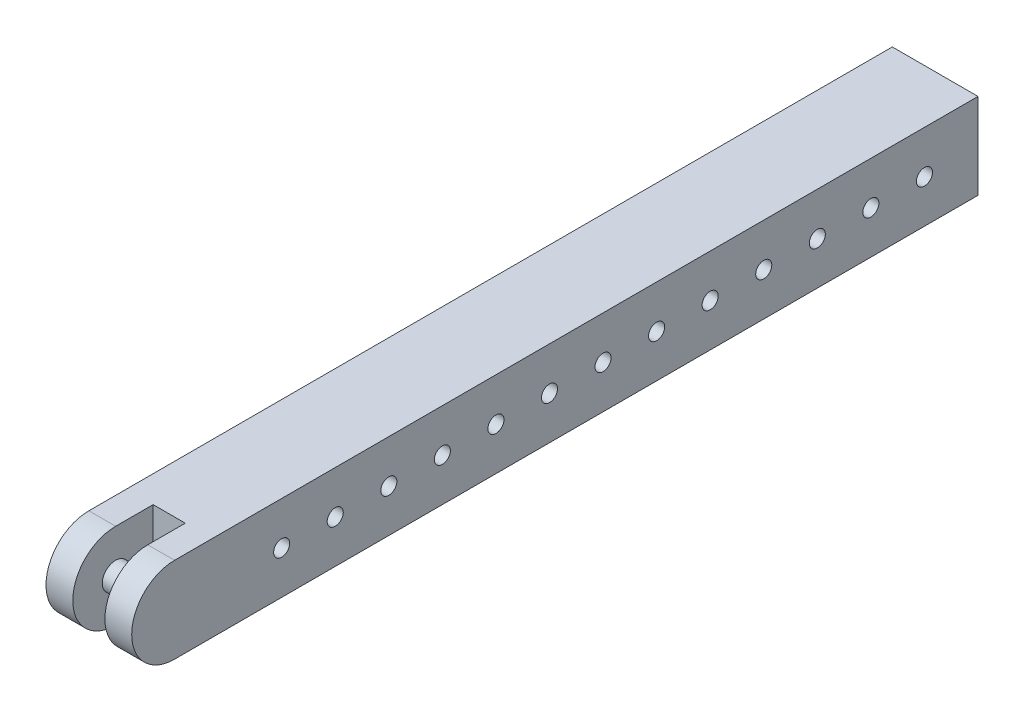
ISO-10303-21;
HEADER;
FILE_DESCRIPTION(('STEP AP214'),'2;1');
FILE_NAME('part.step','',(''),(''),'','','');
FILE_SCHEMA(('AUTOMOTIVE_DESIGN { 1 0 10303 214 1 1 1 1 }'));
ENDSEC;
DATA;
#1=APPLICATION_CONTEXT('core data for automotive mechanical design processes');
#2=APPLICATION_PROTOCOL_DEFINITION('international standard','automotive_design',2000,#1);
#3=PRODUCT_CONTEXT('',#1,'mechanical');
#4=PRODUCT('Part','Part','',(#3));
#5=PRODUCT_RELATED_PRODUCT_CATEGORY('part','',(#4));
#6=PRODUCT_DEFINITION_FORMATION('','',#4);
#7=PRODUCT_DEFINITION_CONTEXT('part definition',#1,'design');
#8=PRODUCT_DEFINITION('design','',#6,#7);
#9=PRODUCT_DEFINITION_SHAPE('','',#8);
#10=(LENGTH_UNIT() NAMED_UNIT(*) SI_UNIT(.MILLI.,.METRE.));
#11=(NAMED_UNIT(*) PLANE_ANGLE_UNIT() SI_UNIT($,.RADIAN.));
#12=(NAMED_UNIT(*) SI_UNIT($,.STERADIAN.) SOLID_ANGLE_UNIT());
#13=UNCERTAINTY_MEASURE_WITH_UNIT(LENGTH_MEASURE(1.E-05),#10,'distance_accuracy_value','');
#14=(GEOMETRIC_REPRESENTATION_CONTEXT(3) GLOBAL_UNCERTAINTY_ASSIGNED_CONTEXT((#13)) GLOBAL_UNIT_ASSIGNED_CONTEXT((#10,
#11,#12)) REPRESENTATION_CONTEXT('',''));
#15=CARTESIAN_POINT('',(0.,0.,0.));
#16=DIRECTION('',(0.,0.,1.));
#17=DIRECTION('',(1.,0.,0.));
#18=AXIS2_PLACEMENT_3D('',#15,#16,#17);
#19=CARTESIAN_POINT('',(-38.6274169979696,8.,150.));
#20=DIRECTION('',(1.,0.,0.));
#21=DIRECTION('',(0.,1.,0.));
#22=AXIS2_PLACEMENT_3D('',#19,#20,#21);
#23=CYLINDRICAL_SURFACE('',#22,8.00000000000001);
#24=DIRECTION('',(-1.,0.,0.));
#25=VECTOR('',#24,1.);
#26=CARTESIAN_POINT('',(0.,16.,150.));
#27=LINE('',#26,#25);
#28=CARTESIAN_POINT('',(0.,16.,150.));
#29=VERTEX_POINT('',#28);
#30=CARTESIAN_POINT('',(-5.,16.,150.));
#31=VERTEX_POINT('',#30);
#32=EDGE_CURVE('E83',#29,#31,#27,.T.);
#33=ORIENTED_EDGE('',*,*,#32,.T.);
#34=CARTESIAN_POINT('',(-5.,8.,150.));
#35=DIRECTION('',(-1.,0.,0.));
#36=DIRECTION('',(0.,0.,1.));
#37=AXIS2_PLACEMENT_3D('',#34,#35,#36);
#38=CIRCLE('',#37,8.00000000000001);
#39=CARTESIAN_POINT('',(-5.,0.,150.));
#40=VERTEX_POINT('',#39);
#41=EDGE_CURVE('E169',#31,#40,#38,.F.);
#42=ORIENTED_EDGE('',*,*,#41,.T.);
#43=DIRECTION('',(-1.,0.,0.));
#44=VECTOR('',#43,1.);
#45=CARTESIAN_POINT('',(0.,0.,150.));
#46=LINE('',#45,#44);
#47=CARTESIAN_POINT('',(0.,0.,150.));
#48=VERTEX_POINT('',#47);
#49=EDGE_CURVE('E150',#48,#40,#46,.T.);
#50=ORIENTED_EDGE('',*,*,#49,.F.);
#51=CARTESIAN_POINT('',(0.,8.,150.));
#52=DIRECTION('',(1.,0.,0.));
#53=DIRECTION('',(0.,1.,0.));
#54=AXIS2_PLACEMENT_3D('',#51,#52,#53);
#55=CIRCLE('',#54,8.00000000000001);
#56=EDGE_CURVE('E141',#29,#48,#55,.T.);
#57=ORIENTED_EDGE('',*,*,#56,.F.);
#58=EDGE_LOOP('',(#33,#42,#50,#57));
#59=FACE_BOUND('',#58,.T.);
#60=ADVANCED_FACE('F33',(#59),#23,.T.);
#61=CARTESIAN_POINT('',(0.,0.,150.));
#62=DIRECTION('',(-1.,0.,0.));
#63=DIRECTION('',(0.,-1.,0.));
#64=AXIS2_PLACEMENT_3D('',#61,#62,#63);
#65=PLANE('',#64);
#66=CARTESIAN_POINT('',(0.,8.,10.));
#67=DIRECTION('',(1.,0.,0.));
#68=DIRECTION('',(0.,1.,0.));
#69=AXIS2_PLACEMENT_3D('',#66,#67,#68);
#70=CIRCLE('',#69,1.5);
#71=CARTESIAN_POINT('',(0.,9.5,10.));
#72=VERTEX_POINT('',#71);
#73=EDGE_CURVE('E418',#72,#72,#70,.T.);
#74=ORIENTED_EDGE('',*,*,#73,.F.);
#75=EDGE_LOOP('',(#74));
#76=FACE_BOUND('',#75,.T.);
#77=CARTESIAN_POINT('',(0.,8.,20.));
#78=DIRECTION('',(1.,0.,0.));
#79=DIRECTION('',(0.,1.,0.));
#80=AXIS2_PLACEMENT_3D('',#77,#78,#79);
#81=CIRCLE('',#80,1.5);
#82=CARTESIAN_POINT('',(0.,9.5,20.));
#83=VERTEX_POINT('',#82);
#84=EDGE_CURVE('E420',#83,#83,#81,.T.);
#85=ORIENTED_EDGE('',*,*,#84,.F.);
#86=EDGE_LOOP('',(#85));
#87=FACE_BOUND('',#86,.T.);
#88=CARTESIAN_POINT('',(0.,8.,30.));
#89=DIRECTION('',(1.,0.,0.));
#90=DIRECTION('',(0.,1.,0.));
#91=AXIS2_PLACEMENT_3D('',#88,#89,#90);
#92=CIRCLE('',#91,1.5);
#93=CARTESIAN_POINT('',(0.,9.5,30.));
#94=VERTEX_POINT('',#93);
#95=EDGE_CURVE('E426',#94,#94,#92,.T.);
#96=ORIENTED_EDGE('',*,*,#95,.F.);
#97=EDGE_LOOP('',(#96));
#98=FACE_BOUND('',#97,.T.);
#99=CARTESIAN_POINT('',(0.,8.,40.));
#100=DIRECTION('',(1.,0.,0.));
#101=DIRECTION('',(0.,1.,0.));
#102=AXIS2_PLACEMENT_3D('',#99,#100,#101);
#103=CIRCLE('',#102,1.5);
#104=CARTESIAN_POINT('',(0.,9.5,40.));
#105=VERTEX_POINT('',#104);
#106=EDGE_CURVE('E432',#105,#105,#103,.T.);
#107=ORIENTED_EDGE('',*,*,#106,.F.);
#108=EDGE_LOOP('',(#107));
#109=FACE_BOUND('',#108,.T.);
#110=CARTESIAN_POINT('',(0.,8.,50.));
#111=DIRECTION('',(1.,0.,0.));
#112=DIRECTION('',(0.,1.,0.));
#113=AXIS2_PLACEMENT_3D('',#110,#111,#112);
#114=CIRCLE('',#113,1.5);
#115=CARTESIAN_POINT('',(0.,9.5,50.));
#116=VERTEX_POINT('',#115);
#117=EDGE_CURVE('E438',#116,#116,#114,.T.);
#118=ORIENTED_EDGE('',*,*,#117,.F.);
#119=EDGE_LOOP('',(#118));
#120=FACE_BOUND('',#119,.T.);
#121=CARTESIAN_POINT('',(0.,8.,60.));
#122=DIRECTION('',(1.,0.,0.));
#123=DIRECTION('',(0.,1.,0.));
#124=AXIS2_PLACEMENT_3D('',#121,#122,#123);
#125=CIRCLE('',#124,1.5);
#126=CARTESIAN_POINT('',(0.,9.5,60.));
#127=VERTEX_POINT('',#126);
#128=EDGE_CURVE('E444',#127,#127,#125,.T.);
#129=ORIENTED_EDGE('',*,*,#128,.F.);
#130=EDGE_LOOP('',(#129));
#131=FACE_BOUND('',#130,.T.);
#132=CARTESIAN_POINT('',(0.,8.,70.));
#133=DIRECTION('',(1.,0.,0.));
#134=DIRECTION('',(0.,1.,0.));
#135=AXIS2_PLACEMENT_3D('',#132,#133,#134);
#136=CIRCLE('',#135,1.5);
#137=CARTESIAN_POINT('',(0.,9.5,70.));
#138=VERTEX_POINT('',#137);
#139=EDGE_CURVE('E450',#138,#138,#136,.T.);
#140=ORIENTED_EDGE('',*,*,#139,.F.);
#141=EDGE_LOOP('',(#140));
#142=FACE_BOUND('',#141,.T.);
#143=CARTESIAN_POINT('',(0.,8.,80.));
#144=DIRECTION('',(1.,0.,0.));
#145=DIRECTION('',(0.,1.,0.));
#146=AXIS2_PLACEMENT_3D('',#143,#144,#145);
#147=CIRCLE('',#146,1.5);
#148=CARTESIAN_POINT('',(0.,9.5,80.));
#149=VERTEX_POINT('',#148);
#150=EDGE_CURVE('E456',#149,#149,#147,.T.);
#151=ORIENTED_EDGE('',*,*,#150,.F.);
#152=EDGE_LOOP('',(#151));
#153=FACE_BOUND('',#152,.T.);
#154=CARTESIAN_POINT('',(0.,8.,90.));
#155=DIRECTION('',(1.,0.,0.));
#156=DIRECTION('',(0.,1.,0.));
#157=AXIS2_PLACEMENT_3D('',#154,#155,#156);
#158=CIRCLE('',#157,1.5);
#159=CARTESIAN_POINT('',(0.,9.5,90.));
#160=VERTEX_POINT('',#159);
#161=EDGE_CURVE('E462',#160,#160,#158,.T.);
#162=ORIENTED_EDGE('',*,*,#161,.F.);
#163=EDGE_LOOP('',(#162));
#164=FACE_BOUND('',#163,.T.);
#165=CARTESIAN_POINT('',(0.,8.,100.));
#166=DIRECTION('',(1.,0.,0.));
#167=DIRECTION('',(0.,1.,0.));
#168=AXIS2_PLACEMENT_3D('',#165,#166,#167);
#169=CIRCLE('',#168,1.5);
#170=CARTESIAN_POINT('',(0.,9.5,100.));
#171=VERTEX_POINT('',#170);
#172=EDGE_CURVE('E468',#171,#171,#169,.T.);
#173=ORIENTED_EDGE('',*,*,#172,.F.);
#174=EDGE_LOOP('',(#173));
#175=FACE_BOUND('',#174,.T.);
#176=CARTESIAN_POINT('',(0.,8.,110.));
#177=DIRECTION('',(1.,0.,0.));
#178=DIRECTION('',(0.,1.,0.));
#179=AXIS2_PLACEMENT_3D('',#176,#177,#178);
#180=CIRCLE('',#179,1.5);
#181=CARTESIAN_POINT('',(0.,9.5,110.));
#182=VERTEX_POINT('',#181);
#183=EDGE_CURVE('E474',#182,#182,#180,.T.);
#184=ORIENTED_EDGE('',*,*,#183,.F.);
#185=EDGE_LOOP('',(#184));
#186=FACE_BOUND('',#185,.T.);
#187=CARTESIAN_POINT('',(0.,8.,120.));
#188=DIRECTION('',(1.,0.,0.));
#189=DIRECTION('',(0.,1.,0.));
#190=AXIS2_PLACEMENT_3D('',#187,#188,#189);
#191=CIRCLE('',#190,1.5);
#192=CARTESIAN_POINT('',(0.,9.5,120.));
#193=VERTEX_POINT('',#192);
#194=EDGE_CURVE('E480',#193,#193,#191,.T.);
#195=ORIENTED_EDGE('',*,*,#194,.F.);
#196=EDGE_LOOP('',(#195));
#197=FACE_BOUND('',#196,.T.);
#198=CARTESIAN_POINT('',(0.,8.,130.));
#199=DIRECTION('',(1.,0.,0.));
#200=DIRECTION('',(0.,1.,0.));
#201=AXIS2_PLACEMENT_3D('',#198,#199,#200);
#202=CIRCLE('',#201,1.5);
#203=CARTESIAN_POINT('',(0.,9.5,130.));
#204=VERTEX_POINT('',#203);
#205=EDGE_CURVE('E486',#204,#204,#202,.T.);
#206=ORIENTED_EDGE('',*,*,#205,.F.);
#207=EDGE_LOOP('',(#206));
#208=FACE_BOUND('',#207,.T.);
#209=DIRECTION('',(0.,0.,-1.));
#210=VECTOR('',#209,1.);
#211=CARTESIAN_POINT('',(0.,16.,150.));
#212=LINE('',#211,#210);
#213=CARTESIAN_POINT('',(0.,16.,0.));
#214=VERTEX_POINT('',#213);
#215=EDGE_CURVE('E167',#29,#214,#212,.T.);
#216=ORIENTED_EDGE('',*,*,#215,.F.);
#217=ORIENTED_EDGE('',*,*,#56,.T.);
#218=DIRECTION('',(0.,0.,-1.));
#219=VECTOR('',#218,1.);
#220=CARTESIAN_POINT('',(0.,0.,150.));
#221=LINE('',#220,#219);
#222=CARTESIAN_POINT('',(0.,0.,0.));
#223=VERTEX_POINT('',#222);
#224=EDGE_CURVE('E57',#48,#223,#221,.T.);
#225=ORIENTED_EDGE('',*,*,#224,.T.);
#226=DIRECTION('',(0.,1.,0.));
#227=VECTOR('',#226,1.);
#228=CARTESIAN_POINT('',(0.,0.,0.));
#229=LINE('',#228,#227);
#230=EDGE_CURVE('E147',#223,#214,#229,.T.);
#231=ORIENTED_EDGE('',*,*,#230,.T.);
#232=EDGE_LOOP('',(#216,#217,#225,#231));
#233=FACE_BOUND('',#232,.T.);
#234=ADVANCED_FACE('F35',(#76,#87,#98,#109,#120,#131,#142,#153,#164,#175,#186,#197,#208,#233),
#65,.F.);
#235=CARTESIAN_POINT('',(0.,16.,150.));
#236=DIRECTION('',(0.,-1.,0.));
#237=DIRECTION('',(1.,0.,0.));
#238=AXIS2_PLACEMENT_3D('',#235,#236,#237);
#239=PLANE('',#238);
#240=CARTESIAN_POINT('',(-11.,16.,150.));
#241=VERTEX_POINT('',#240);
#242=CARTESIAN_POINT('',(-16.,16.,150.));
#243=VERTEX_POINT('',#242);
#244=EDGE_CURVE('E130',#241,#243,#27,.T.);
#245=ORIENTED_EDGE('',*,*,#244,.F.);
#246=DIRECTION('',(0.,0.,-1.));
#247=VECTOR('',#246,1.);
#248=CARTESIAN_POINT('',(-11.,16.,163.425882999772));
#249=LINE('',#248,#247);
#250=CARTESIAN_POINT('',(-11.,16.,143.));
#251=VERTEX_POINT('',#250);
#252=EDGE_CURVE('E112',#241,#251,#249,.T.);
#253=ORIENTED_EDGE('',*,*,#252,.T.);
#254=DIRECTION('',(1.,0.,0.));
#255=VECTOR('',#254,1.);
#256=CARTESIAN_POINT('',(-11.,16.,143.));
#257=LINE('',#256,#255);
#258=CARTESIAN_POINT('',(-5.,16.,143.));
#259=VERTEX_POINT('',#258);
#260=EDGE_CURVE('E124',#251,#259,#257,.T.);
#261=ORIENTED_EDGE('',*,*,#260,.T.);
#262=DIRECTION('',(0.,0.,-1.));
#263=VECTOR('',#262,1.);
#264=CARTESIAN_POINT('',(-5.,16.,163.425882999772));
#265=LINE('',#264,#263);
#266=EDGE_CURVE('E120',#31,#259,#265,.T.);
#267=ORIENTED_EDGE('',*,*,#266,.F.);
#268=ORIENTED_EDGE('',*,*,#32,.F.);
#269=ORIENTED_EDGE('',*,*,#215,.T.);
#270=DIRECTION('',(-1.,0.,0.));
#271=VECTOR('',#270,1.);
#272=CARTESIAN_POINT('',(0.,16.,0.));
#273=LINE('',#272,#271);
#274=CARTESIAN_POINT('',(-16.,16.,0.));
#275=VERTEX_POINT('',#274);
#276=EDGE_CURVE('E153',#214,#275,#273,.T.);
#277=ORIENTED_EDGE('',*,*,#276,.T.);
#278=DIRECTION('',(0.,0.,-1.));
#279=VECTOR('',#278,1.);
#280=CARTESIAN_POINT('',(-16.,16.,150.));
#281=LINE('',#280,#279);
#282=EDGE_CURVE('E165',#243,#275,#281,.T.);
#283=ORIENTED_EDGE('',*,*,#282,.F.);
#284=EDGE_LOOP('',(#245,#253,#261,#267,#268,#269,#277,#283));
#285=FACE_BOUND('',#284,.T.);
#286=ADVANCED_FACE('F128',(#285),#239,.F.);
#287=CARTESIAN_POINT('',(-16.,0.,150.));
#288=DIRECTION('',(-1.,0.,0.));
#289=DIRECTION('',(0.,0.,1.));
#290=AXIS2_PLACEMENT_3D('',#287,#288,#289);
#291=PLANE('',#290);
#292=CARTESIAN_POINT('',(-16.,8.,10.));
#293=DIRECTION('',(1.,0.,0.));
#294=DIRECTION('',(0.,1.,0.));
#295=AXIS2_PLACEMENT_3D('',#292,#293,#294);
#296=CIRCLE('',#295,1.5);
#297=CARTESIAN_POINT('',(-16.,9.5,10.));
#298=VERTEX_POINT('',#297);
#299=EDGE_CURVE('E415',#298,#298,#296,.T.);
#300=ORIENTED_EDGE('',*,*,#299,.T.);
#301=EDGE_LOOP('',(#300));
#302=FACE_BOUND('',#301,.T.);
#303=CARTESIAN_POINT('',(-16.,8.,20.));
#304=DIRECTION('',(1.,0.,0.));
#305=DIRECTION('',(0.,1.,0.));
#306=AXIS2_PLACEMENT_3D('',#303,#304,#305);
#307=CIRCLE('',#306,1.5);
#308=CARTESIAN_POINT('',(-16.,9.5,20.));
#309=VERTEX_POINT('',#308);
#310=EDGE_CURVE('E423',#309,#309,#307,.T.);
#311=ORIENTED_EDGE('',*,*,#310,.T.);
#312=EDGE_LOOP('',(#311));
#313=FACE_BOUND('',#312,.T.);
#314=CARTESIAN_POINT('',(-16.,8.,30.));
#315=DIRECTION('',(1.,0.,0.));
#316=DIRECTION('',(0.,1.,0.));
#317=AXIS2_PLACEMENT_3D('',#314,#315,#316);
#318=CIRCLE('',#317,1.5);
#319=CARTESIAN_POINT('',(-16.,9.5,30.));
#320=VERTEX_POINT('',#319);
#321=EDGE_CURVE('E429',#320,#320,#318,.T.);
#322=ORIENTED_EDGE('',*,*,#321,.T.);
#323=EDGE_LOOP('',(#322));
#324=FACE_BOUND('',#323,.T.);
#325=CARTESIAN_POINT('',(-16.,8.,40.));
#326=DIRECTION('',(1.,0.,0.));
#327=DIRECTION('',(0.,1.,0.));
#328=AXIS2_PLACEMENT_3D('',#325,#326,#327);
#329=CIRCLE('',#328,1.5);
#330=CARTESIAN_POINT('',(-16.,9.5,40.));
#331=VERTEX_POINT('',#330);
#332=EDGE_CURVE('E435',#331,#331,#329,.T.);
#333=ORIENTED_EDGE('',*,*,#332,.T.);
#334=EDGE_LOOP('',(#333));
#335=FACE_BOUND('',#334,.T.);
#336=CARTESIAN_POINT('',(-16.,8.,50.));
#337=DIRECTION('',(1.,0.,0.));
#338=DIRECTION('',(0.,1.,0.));
#339=AXIS2_PLACEMENT_3D('',#336,#337,#338);
#340=CIRCLE('',#339,1.5);
#341=CARTESIAN_POINT('',(-16.,9.5,50.));
#342=VERTEX_POINT('',#341);
#343=EDGE_CURVE('E441',#342,#342,#340,.T.);
#344=ORIENTED_EDGE('',*,*,#343,.T.);
#345=EDGE_LOOP('',(#344));
#346=FACE_BOUND('',#345,.T.);
#347=CARTESIAN_POINT('',(-16.,8.,60.));
#348=DIRECTION('',(1.,0.,0.));
#349=DIRECTION('',(0.,1.,0.));
#350=AXIS2_PLACEMENT_3D('',#347,#348,#349);
#351=CIRCLE('',#350,1.5);
#352=CARTESIAN_POINT('',(-16.,9.5,60.));
#353=VERTEX_POINT('',#352);
#354=EDGE_CURVE('E447',#353,#353,#351,.T.);
#355=ORIENTED_EDGE('',*,*,#354,.T.);
#356=EDGE_LOOP('',(#355));
#357=FACE_BOUND('',#356,.T.);
#358=CARTESIAN_POINT('',(-16.,8.,70.));
#359=DIRECTION('',(1.,0.,0.));
#360=DIRECTION('',(0.,1.,0.));
#361=AXIS2_PLACEMENT_3D('',#358,#359,#360);
#362=CIRCLE('',#361,1.5);
#363=CARTESIAN_POINT('',(-16.,9.5,70.));
#364=VERTEX_POINT('',#363);
#365=EDGE_CURVE('E453',#364,#364,#362,.T.);
#366=ORIENTED_EDGE('',*,*,#365,.T.);
#367=EDGE_LOOP('',(#366));
#368=FACE_BOUND('',#367,.T.);
#369=CARTESIAN_POINT('',(-16.,8.,80.));
#370=DIRECTION('',(1.,0.,0.));
#371=DIRECTION('',(0.,1.,0.));
#372=AXIS2_PLACEMENT_3D('',#369,#370,#371);
#373=CIRCLE('',#372,1.5);
#374=CARTESIAN_POINT('',(-16.,9.5,80.));
#375=VERTEX_POINT('',#374);
#376=EDGE_CURVE('E459',#375,#375,#373,.T.);
#377=ORIENTED_EDGE('',*,*,#376,.T.);
#378=EDGE_LOOP('',(#377));
#379=FACE_BOUND('',#378,.T.);
#380=CARTESIAN_POINT('',(-16.,8.,90.));
#381=DIRECTION('',(1.,0.,0.));
#382=DIRECTION('',(0.,1.,0.));
#383=AXIS2_PLACEMENT_3D('',#380,#381,#382);
#384=CIRCLE('',#383,1.5);
#385=CARTESIAN_POINT('',(-16.,9.5,90.));
#386=VERTEX_POINT('',#385);
#387=EDGE_CURVE('E465',#386,#386,#384,.T.);
#388=ORIENTED_EDGE('',*,*,#387,.T.);
#389=EDGE_LOOP('',(#388));
#390=FACE_BOUND('',#389,.T.);
#391=CARTESIAN_POINT('',(-16.,8.,100.));
#392=DIRECTION('',(1.,0.,0.));
#393=DIRECTION('',(0.,1.,0.));
#394=AXIS2_PLACEMENT_3D('',#391,#392,#393);
#395=CIRCLE('',#394,1.5);
#396=CARTESIAN_POINT('',(-16.,9.5,100.));
#397=VERTEX_POINT('',#396);
#398=EDGE_CURVE('E471',#397,#397,#395,.T.);
#399=ORIENTED_EDGE('',*,*,#398,.T.);
#400=EDGE_LOOP('',(#399));
#401=FACE_BOUND('',#400,.T.);
#402=CARTESIAN_POINT('',(-16.,8.,110.));
#403=DIRECTION('',(1.,0.,0.));
#404=DIRECTION('',(0.,1.,0.));
#405=AXIS2_PLACEMENT_3D('',#402,#403,#404);
#406=CIRCLE('',#405,1.5);
#407=CARTESIAN_POINT('',(-16.,9.5,110.));
#408=VERTEX_POINT('',#407);
#409=EDGE_CURVE('E477',#408,#408,#406,.T.);
#410=ORIENTED_EDGE('',*,*,#409,.T.);
#411=EDGE_LOOP('',(#410));
#412=FACE_BOUND('',#411,.T.);
#413=CARTESIAN_POINT('',(-16.,8.,120.));
#414=DIRECTION('',(1.,0.,0.));
#415=DIRECTION('',(0.,1.,0.));
#416=AXIS2_PLACEMENT_3D('',#413,#414,#415);
#417=CIRCLE('',#416,1.5);
#418=CARTESIAN_POINT('',(-16.,9.5,120.));
#419=VERTEX_POINT('',#418);
#420=EDGE_CURVE('E483',#419,#419,#417,.T.);
#421=ORIENTED_EDGE('',*,*,#420,.T.);
#422=EDGE_LOOP('',(#421));
#423=FACE_BOUND('',#422,.T.);
#424=CARTESIAN_POINT('',(-16.,8.,130.));
#425=DIRECTION('',(1.,0.,0.));
#426=DIRECTION('',(0.,1.,0.));
#427=AXIS2_PLACEMENT_3D('',#424,#425,#426);
#428=CIRCLE('',#427,1.5);
#429=CARTESIAN_POINT('',(-16.,9.5,130.));
#430=VERTEX_POINT('',#429);
#431=EDGE_CURVE('E489',#430,#430,#428,.T.);
#432=ORIENTED_EDGE('',*,*,#431,.T.);
#433=EDGE_LOOP('',(#432));
#434=FACE_BOUND('',#433,.T.);
#435=DIRECTION('',(0.,0.,-1.));
#436=VECTOR('',#435,1.);
#437=CARTESIAN_POINT('',(-16.,0.,150.));
#438=LINE('',#437,#436);
#439=CARTESIAN_POINT('',(-16.,0.,150.));
#440=VERTEX_POINT('',#439);
#441=CARTESIAN_POINT('',(-16.,0.,0.));
#442=VERTEX_POINT('',#441);
#443=EDGE_CURVE('E163',#440,#442,#438,.T.);
#444=ORIENTED_EDGE('',*,*,#443,.F.);
#445=CARTESIAN_POINT('',(-16.,8.,150.));
#446=DIRECTION('',(-1.,0.,0.));
#447=DIRECTION('',(0.,0.,1.));
#448=AXIS2_PLACEMENT_3D('',#445,#446,#447);
#449=CIRCLE('',#448,8.00000000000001);
#450=EDGE_CURVE('E144',#243,#440,#449,.F.);
#451=ORIENTED_EDGE('',*,*,#450,.F.);
#452=ORIENTED_EDGE('',*,*,#282,.T.);
#453=DIRECTION('',(0.,1.,0.));
#454=VECTOR('',#453,1.);
#455=CARTESIAN_POINT('',(-16.,0.,0.));
#456=LINE('',#455,#454);
#457=EDGE_CURVE('E156',#442,#275,#456,.T.);
#458=ORIENTED_EDGE('',*,*,#457,.F.);
#459=EDGE_LOOP('',(#444,#451,#452,#458));
#460=FACE_BOUND('',#459,.T.);
#461=ADVANCED_FACE('F177',(#302,#313,#324,#335,#346,#357,#368,#379,#390,#401,#412,#423,#434,
#460),#291,.T.);
#462=CARTESIAN_POINT('',(0.,0.,150.));
#463=DIRECTION('',(0.,-1.,0.));
#464=DIRECTION('',(0.,0.,-1.));
#465=AXIS2_PLACEMENT_3D('',#462,#463,#464);
#466=PLANE('',#465);
#467=DIRECTION('',(0.,0.,-1.));
#468=VECTOR('',#467,1.);
#469=CARTESIAN_POINT('',(-11.,0.,163.425882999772));
#470=LINE('',#469,#468);
#471=CARTESIAN_POINT('',(-11.,0.,150.));
#472=VERTEX_POINT('',#471);
#473=CARTESIAN_POINT('',(-11.,0.,143.));
#474=VERTEX_POINT('',#473);
#475=EDGE_CURVE('E115',#472,#474,#470,.T.);
#476=ORIENTED_EDGE('',*,*,#475,.F.);
#477=EDGE_CURVE('E149',#472,#440,#46,.T.);
#478=ORIENTED_EDGE('',*,*,#477,.T.);
#479=ORIENTED_EDGE('',*,*,#443,.T.);
#480=DIRECTION('',(-1.,0.,0.));
#481=VECTOR('',#480,1.);
#482=CARTESIAN_POINT('',(0.,0.,0.));
#483=LINE('',#482,#481);
#484=EDGE_CURVE('E159',#223,#442,#483,.T.);
#485=ORIENTED_EDGE('',*,*,#484,.F.);
#486=ORIENTED_EDGE('',*,*,#224,.F.);
#487=ORIENTED_EDGE('',*,*,#49,.T.);
#488=DIRECTION('',(0.,0.,-1.));
#489=VECTOR('',#488,1.);
#490=CARTESIAN_POINT('',(-5.,0.,163.425882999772));
#491=LINE('',#490,#489);
#492=CARTESIAN_POINT('',(-5.,0.,143.));
#493=VERTEX_POINT('',#492);
#494=EDGE_CURVE('E48',#40,#493,#491,.T.);
#495=ORIENTED_EDGE('',*,*,#494,.T.);
#496=DIRECTION('',(1.,0.,0.));
#497=VECTOR('',#496,1.);
#498=CARTESIAN_POINT('',(-11.,0.,143.));
#499=LINE('',#498,#497);
#500=EDGE_CURVE('E132',#474,#493,#499,.T.);
#501=ORIENTED_EDGE('',*,*,#500,.F.);
#502=EDGE_LOOP('',(#476,#478,#479,#485,#486,#487,#495,#501));
#503=FACE_BOUND('',#502,.T.);
#504=ADVANCED_FACE('F172',(#503),#466,.T.);
#505=CARTESIAN_POINT('',(0.,0.,0.));
#506=DIRECTION('',(0.,0.,1.));
#507=DIRECTION('',(1.,0.,0.));
#508=AXIS2_PLACEMENT_3D('',#505,#506,#507);
#509=PLANE('',#508);
#510=ORIENTED_EDGE('',*,*,#230,.F.);
#511=ORIENTED_EDGE('',*,*,#484,.T.);
#512=ORIENTED_EDGE('',*,*,#457,.T.);
#513=ORIENTED_EDGE('',*,*,#276,.F.);
#514=EDGE_LOOP('',(#510,#511,#512,#513));
#515=FACE_BOUND('',#514,.T.);
#516=ADVANCED_FACE('F180',(#515),#509,.F.);
#517=CARTESIAN_POINT('',(-11.,8.,150.));
#518=DIRECTION('',(-1.,0.,0.));
#519=DIRECTION('',(0.,0.,1.));
#520=AXIS2_PLACEMENT_3D('',#517,#518,#519);
#521=CIRCLE('',#520,8.00000000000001);
#522=EDGE_CURVE('E41',#241,#472,#521,.F.);
#523=ORIENTED_EDGE('',*,*,#522,.F.);
#524=ORIENTED_EDGE('',*,*,#244,.T.);
#525=ORIENTED_EDGE('',*,*,#450,.T.);
#526=ORIENTED_EDGE('',*,*,#477,.F.);
#527=EDGE_LOOP('',(#523,#524,#525,#526));
#528=FACE_BOUND('',#527,.T.);
#529=ADVANCED_FACE('F174',(#528),#23,.T.);
#530=CARTESIAN_POINT('',(-11.,16.,163.425882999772));
#531=DIRECTION('',(-1.,0.,0.));
#532=DIRECTION('',(0.,0.,1.));
#533=AXIS2_PLACEMENT_3D('',#530,#531,#532);
#534=PLANE('',#533);
#535=CARTESIAN_POINT('',(-11.,8.,150.));
#536=DIRECTION('',(-1.,0.,0.));
#537=DIRECTION('',(0.,0.,1.));
#538=AXIS2_PLACEMENT_3D('',#535,#536,#537);
#539=CIRCLE('',#538,2.5);
#540=CARTESIAN_POINT('',(-11.,8.,152.5));
#541=VERTEX_POINT('',#540);
#542=EDGE_CURVE('E135',#541,#541,#539,.T.);
#543=ORIENTED_EDGE('',*,*,#542,.T.);
#544=EDGE_LOOP('',(#543));
#545=FACE_BOUND('',#544,.T.);
#546=ORIENTED_EDGE('',*,*,#522,.T.);
#547=ORIENTED_EDGE('',*,*,#475,.T.);
#548=DIRECTION('',(0.,-1.,0.));
#549=VECTOR('',#548,1.);
#550=CARTESIAN_POINT('',(-11.,16.,143.));
#551=LINE('',#550,#549);
#552=EDGE_CURVE('E108',#251,#474,#551,.T.);
#553=ORIENTED_EDGE('',*,*,#552,.F.);
#554=ORIENTED_EDGE('',*,*,#252,.F.);
#555=EDGE_LOOP('',(#546,#547,#553,#554));
#556=FACE_BOUND('',#555,.T.);
#557=ADVANCED_FACE('F110',(#545,#556),#534,.F.);
#558=CARTESIAN_POINT('',(-5.,16.,163.425882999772));
#559=DIRECTION('',(-1.,0.,0.));
#560=DIRECTION('',(0.,0.,1.));
#561=AXIS2_PLACEMENT_3D('',#558,#559,#560);
#562=PLANE('',#561);
#563=CARTESIAN_POINT('',(-5.,8.,150.));
#564=DIRECTION('',(-1.,0.,0.));
#565=DIRECTION('',(0.,0.,1.));
#566=AXIS2_PLACEMENT_3D('',#563,#564,#565);
#567=CIRCLE('',#566,2.5);
#568=CARTESIAN_POINT('',(-5.,8.,152.5));
#569=VERTEX_POINT('',#568);
#570=EDGE_CURVE('E11',#569,#569,#567,.T.);
#571=ORIENTED_EDGE('',*,*,#570,.F.);
#572=EDGE_LOOP('',(#571));
#573=FACE_BOUND('',#572,.T.);
#574=ORIENTED_EDGE('',*,*,#266,.T.);
#575=DIRECTION('',(0.,-1.,0.));
#576=VECTOR('',#575,1.);
#577=CARTESIAN_POINT('',(-5.,16.,143.));
#578=LINE('',#577,#576);
#579=EDGE_CURVE('E119',#259,#493,#578,.T.);
#580=ORIENTED_EDGE('',*,*,#579,.T.);
#581=ORIENTED_EDGE('',*,*,#494,.F.);
#582=ORIENTED_EDGE('',*,*,#41,.F.);
#583=EDGE_LOOP('',(#574,#580,#581,#582));
#584=FACE_BOUND('',#583,.T.);
#585=ADVANCED_FACE('F183',(#573,#584),#562,.T.);
#586=CARTESIAN_POINT('',(-11.,16.,143.));
#587=DIRECTION('',(0.,0.,-1.));
#588=DIRECTION('',(-1.,0.,0.));
#589=AXIS2_PLACEMENT_3D('',#586,#587,#588);
#590=PLANE('',#589);
#591=ORIENTED_EDGE('',*,*,#500,.T.);
#592=ORIENTED_EDGE('',*,*,#579,.F.);
#593=ORIENTED_EDGE('',*,*,#260,.F.);
#594=ORIENTED_EDGE('',*,*,#552,.T.);
#595=EDGE_LOOP('',(#591,#592,#593,#594));
#596=FACE_BOUND('',#595,.T.);
#597=ADVANCED_FACE('F125',(#596),#590,.F.);
#598=CARTESIAN_POINT('',(-23.0710678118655,8.,150.));
#599=DIRECTION('',(1.,0.,0.));
#600=DIRECTION('',(0.,1.,0.));
#601=AXIS2_PLACEMENT_3D('',#598,#599,#600);
#602=CYLINDRICAL_SURFACE('',#601,2.5);
#603=ORIENTED_EDGE('',*,*,#570,.T.);
#604=EDGE_LOOP('',(#603));
#605=FACE_BOUND('',#604,.T.);
#606=ORIENTED_EDGE('',*,*,#542,.F.);
#607=EDGE_LOOP('',(#606));
#608=FACE_BOUND('',#607,.T.);
#609=ADVANCED_FACE('F191',(#605,#608),#602,.T.);
#610=CARTESIAN_POINT('',(-16.,8.,130.));
#611=DIRECTION('',(1.,0.,0.));
#612=DIRECTION('',(0.,1.,0.));
#613=AXIS2_PLACEMENT_3D('',#610,#611,#612);
#614=CYLINDRICAL_SURFACE('',#613,1.5);
#615=ORIENTED_EDGE('',*,*,#431,.F.);
#616=EDGE_LOOP('',(#615));
#617=FACE_BOUND('',#616,.T.);
#618=ORIENTED_EDGE('',*,*,#205,.T.);
#619=EDGE_LOOP('',(#618));
#620=FACE_BOUND('',#619,.T.);
#621=ADVANCED_FACE('F260',(#617,#620),#614,.F.);
#622=CARTESIAN_POINT('',(-16.,8.,120.));
#623=DIRECTION('',(1.,0.,0.));
#624=DIRECTION('',(0.,1.,0.));
#625=AXIS2_PLACEMENT_3D('',#622,#623,#624);
#626=CYLINDRICAL_SURFACE('',#625,1.5);
#627=ORIENTED_EDGE('',*,*,#420,.F.);
#628=EDGE_LOOP('',(#627));
#629=FACE_BOUND('',#628,.T.);
#630=ORIENTED_EDGE('',*,*,#194,.T.);
#631=EDGE_LOOP('',(#630));
#632=FACE_BOUND('',#631,.T.);
#633=ADVANCED_FACE('F288',(#629,#632),#626,.F.);
#634=CARTESIAN_POINT('',(-16.,8.,110.));
#635=DIRECTION('',(1.,0.,0.));
#636=DIRECTION('',(0.,1.,0.));
#637=AXIS2_PLACEMENT_3D('',#634,#635,#636);
#638=CYLINDRICAL_SURFACE('',#637,1.5);
#639=ORIENTED_EDGE('',*,*,#409,.F.);
#640=EDGE_LOOP('',(#639));
#641=FACE_BOUND('',#640,.T.);
#642=ORIENTED_EDGE('',*,*,#183,.T.);
#643=EDGE_LOOP('',(#642));
#644=FACE_BOUND('',#643,.T.);
#645=ADVANCED_FACE('F295',(#641,#644),#638,.F.);
#646=CARTESIAN_POINT('',(-16.,8.,100.));
#647=DIRECTION('',(1.,0.,0.));
#648=DIRECTION('',(0.,1.,0.));
#649=AXIS2_PLACEMENT_3D('',#646,#647,#648);
#650=CYLINDRICAL_SURFACE('',#649,1.5);
#651=ORIENTED_EDGE('',*,*,#398,.F.);
#652=EDGE_LOOP('',(#651));
#653=FACE_BOUND('',#652,.T.);
#654=ORIENTED_EDGE('',*,*,#172,.T.);
#655=EDGE_LOOP('',(#654));
#656=FACE_BOUND('',#655,.T.);
#657=ADVANCED_FACE('F303',(#653,#656),#650,.F.);
#658=CARTESIAN_POINT('',(-16.,8.,90.));
#659=DIRECTION('',(1.,0.,0.));
#660=DIRECTION('',(0.,1.,0.));
#661=AXIS2_PLACEMENT_3D('',#658,#659,#660);
#662=CYLINDRICAL_SURFACE('',#661,1.5);
#663=ORIENTED_EDGE('',*,*,#387,.F.);
#664=EDGE_LOOP('',(#663));
#665=FACE_BOUND('',#664,.T.);
#666=ORIENTED_EDGE('',*,*,#161,.T.);
#667=EDGE_LOOP('',(#666));
#668=FACE_BOUND('',#667,.T.);
#669=ADVANCED_FACE('F311',(#665,#668),#662,.F.);
#670=CARTESIAN_POINT('',(-16.,8.,80.));
#671=DIRECTION('',(1.,0.,0.));
#672=DIRECTION('',(0.,1.,0.));
#673=AXIS2_PLACEMENT_3D('',#670,#671,#672);
#674=CYLINDRICAL_SURFACE('',#673,1.5);
#675=ORIENTED_EDGE('',*,*,#376,.F.);
#676=EDGE_LOOP('',(#675));
#677=FACE_BOUND('',#676,.T.);
#678=ORIENTED_EDGE('',*,*,#150,.T.);
#679=EDGE_LOOP('',(#678));
#680=FACE_BOUND('',#679,.T.);
#681=ADVANCED_FACE('F319',(#677,#680),#674,.F.);
#682=CARTESIAN_POINT('',(-16.,8.,70.));
#683=DIRECTION('',(1.,0.,0.));
#684=DIRECTION('',(0.,1.,0.));
#685=AXIS2_PLACEMENT_3D('',#682,#683,#684);
#686=CYLINDRICAL_SURFACE('',#685,1.5);
#687=ORIENTED_EDGE('',*,*,#365,.F.);
#688=EDGE_LOOP('',(#687));
#689=FACE_BOUND('',#688,.T.);
#690=ORIENTED_EDGE('',*,*,#139,.T.);
#691=EDGE_LOOP('',(#690));
#692=FACE_BOUND('',#691,.T.);
#693=ADVANCED_FACE('F327',(#689,#692),#686,.F.);
#694=CARTESIAN_POINT('',(-16.,8.,60.));
#695=DIRECTION('',(1.,0.,0.));
#696=DIRECTION('',(0.,1.,0.));
#697=AXIS2_PLACEMENT_3D('',#694,#695,#696);
#698=CYLINDRICAL_SURFACE('',#697,1.5);
#699=ORIENTED_EDGE('',*,*,#354,.F.);
#700=EDGE_LOOP('',(#699));
#701=FACE_BOUND('',#700,.T.);
#702=ORIENTED_EDGE('',*,*,#128,.T.);
#703=EDGE_LOOP('',(#702));
#704=FACE_BOUND('',#703,.T.);
#705=ADVANCED_FACE('F335',(#701,#704),#698,.F.);
#706=CARTESIAN_POINT('',(-16.,8.,50.));
#707=DIRECTION('',(1.,0.,0.));
#708=DIRECTION('',(0.,1.,0.));
#709=AXIS2_PLACEMENT_3D('',#706,#707,#708);
#710=CYLINDRICAL_SURFACE('',#709,1.5);
#711=ORIENTED_EDGE('',*,*,#343,.F.);
#712=EDGE_LOOP('',(#711));
#713=FACE_BOUND('',#712,.T.);
#714=ORIENTED_EDGE('',*,*,#117,.T.);
#715=EDGE_LOOP('',(#714));
#716=FACE_BOUND('',#715,.T.);
#717=ADVANCED_FACE('F343',(#713,#716),#710,.F.);
#718=CARTESIAN_POINT('',(-16.,8.,40.));
#719=DIRECTION('',(1.,0.,0.));
#720=DIRECTION('',(0.,1.,0.));
#721=AXIS2_PLACEMENT_3D('',#718,#719,#720);
#722=CYLINDRICAL_SURFACE('',#721,1.5);
#723=ORIENTED_EDGE('',*,*,#332,.F.);
#724=EDGE_LOOP('',(#723));
#725=FACE_BOUND('',#724,.T.);
#726=ORIENTED_EDGE('',*,*,#106,.T.);
#727=EDGE_LOOP('',(#726));
#728=FACE_BOUND('',#727,.T.);
#729=ADVANCED_FACE('F351',(#725,#728),#722,.F.);
#730=CARTESIAN_POINT('',(-16.,8.,30.));
#731=DIRECTION('',(1.,0.,0.));
#732=DIRECTION('',(0.,1.,0.));
#733=AXIS2_PLACEMENT_3D('',#730,#731,#732);
#734=CYLINDRICAL_SURFACE('',#733,1.5);
#735=ORIENTED_EDGE('',*,*,#321,.F.);
#736=EDGE_LOOP('',(#735));
#737=FACE_BOUND('',#736,.T.);
#738=ORIENTED_EDGE('',*,*,#95,.T.);
#739=EDGE_LOOP('',(#738));
#740=FACE_BOUND('',#739,.T.);
#741=ADVANCED_FACE('F359',(#737,#740),#734,.F.);
#742=CARTESIAN_POINT('',(-16.,8.,20.));
#743=DIRECTION('',(1.,0.,0.));
#744=DIRECTION('',(0.,1.,0.));
#745=AXIS2_PLACEMENT_3D('',#742,#743,#744);
#746=CYLINDRICAL_SURFACE('',#745,1.5);
#747=ORIENTED_EDGE('',*,*,#310,.F.);
#748=EDGE_LOOP('',(#747));
#749=FACE_BOUND('',#748,.T.);
#750=ORIENTED_EDGE('',*,*,#84,.T.);
#751=EDGE_LOOP('',(#750));
#752=FACE_BOUND('',#751,.T.);
#753=ADVANCED_FACE('F367',(#749,#752),#746,.F.);
#754=CARTESIAN_POINT('',(-16.,8.,10.));
#755=DIRECTION('',(1.,0.,0.));
#756=DIRECTION('',(0.,1.,0.));
#757=AXIS2_PLACEMENT_3D('',#754,#755,#756);
#758=CYLINDRICAL_SURFACE('',#757,1.5);
#759=ORIENTED_EDGE('',*,*,#299,.F.);
#760=EDGE_LOOP('',(#759));
#761=FACE_BOUND('',#760,.T.);
#762=ORIENTED_EDGE('',*,*,#73,.T.);
#763=EDGE_LOOP('',(#762));
#764=FACE_BOUND('',#763,.T.);
#765=ADVANCED_FACE('F375',(#761,#764),#758,.F.);
#766=CLOSED_SHELL('',(#60,#234,#286,#461,#504,#516,#529,#557,#585,#597,#609,#621,#633,#645,#657,
#669,#681,#693,#705,#717,#729,#741,#753,#765));
#767=MANIFOLD_SOLID_BREP('B2',#766);
#768=ADVANCED_BREP_SHAPE_REPRESENTATION('',(#18,#767),#14);
#769=SHAPE_DEFINITION_REPRESENTATION(#9,#768);
ENDSEC;
END-ISO-10303-21;
